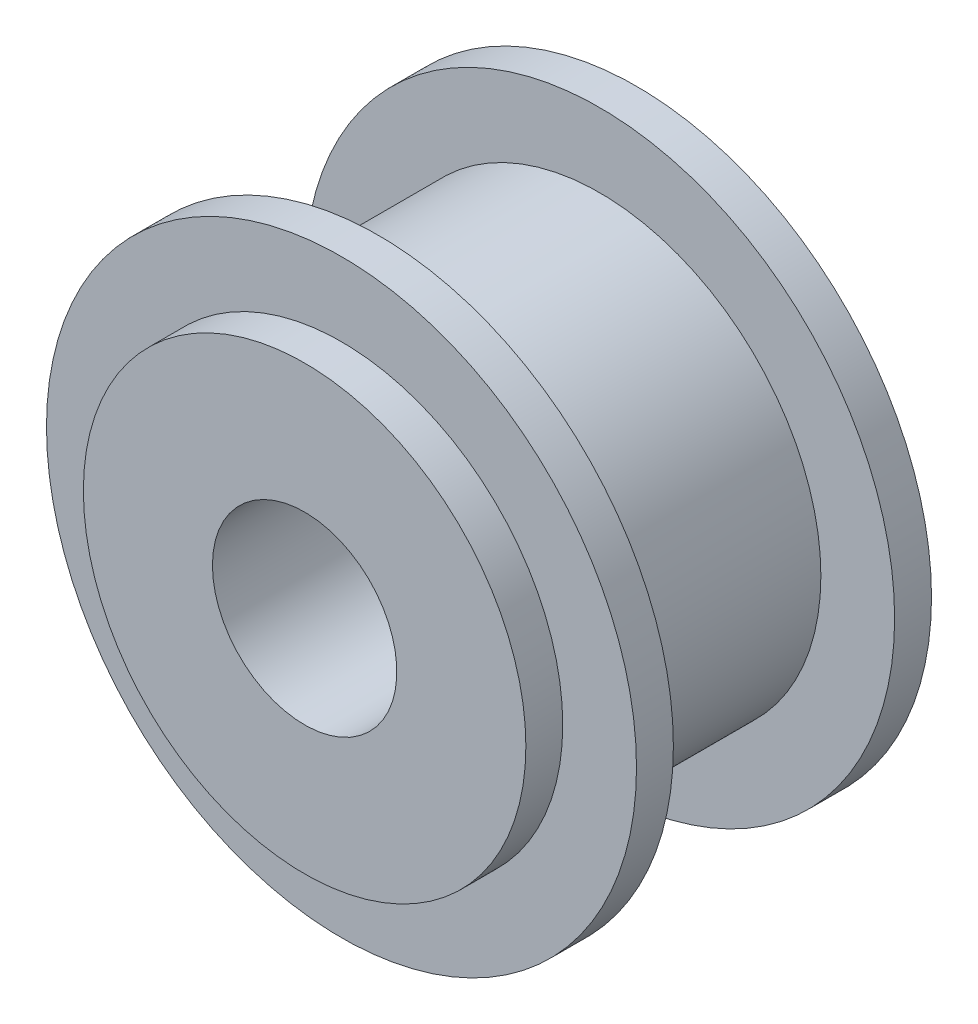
from build123d import *


with BuildPart() as part:
    # Esquisse4 → R_volution1 (revolve)
    with BuildSketch(Plane(origin=(0, 0, 0), x_dir=(0, 0, -1), z_dir=(0.7175961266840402, 0.6964594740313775, 0)), mode=Mode.PRIVATE) as r_volution1_sk:
        Polygon((0, 38.75), (0, 40.5), (-0.5, 40.5), (-0.5, 41.5), (-1, 41.5), (-1, 40.5), (-4, 40.5), (-4, 41.5), (-4.5, 41.5), (-4.5, 40.5), (-5, 40.5), (-5, 38.75), align=None)
    revolve(r_volution1_sk.sketch.rotate(Axis((-26.117230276, 26.909854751, 0), (0, 0, 1)), 45.856367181), axis=Axis((-26.117230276, 26.909854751, 0), (0, 0, 1)))


solid = part.part
